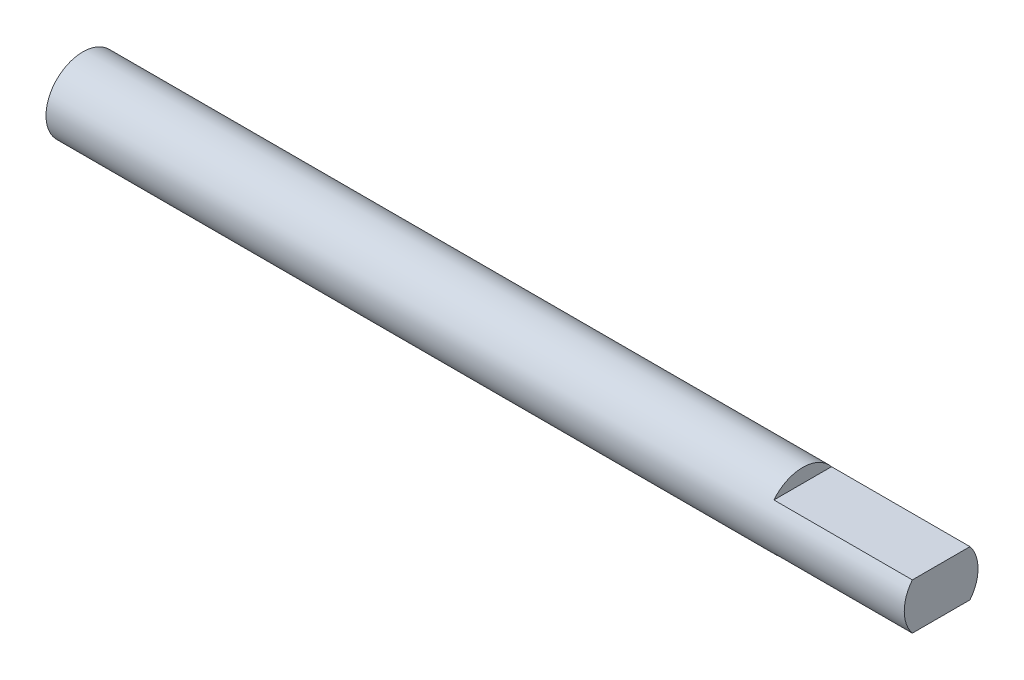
from build123d import *

# Parameters (mm, degrees)
ESQUISSE1_W                  = 93
ESQUISSE1_H                  = 4
ENL_V_MAT_EXTRU_1_DEPTH      = 15
R_P_TITION_CIRCULAIRE1_COUNT = 2


with BuildPart() as part:
    # Esquisse1 → Base-R_volution (revolve)
    with BuildSketch(Plane.XY, mode=Mode.PRIVATE) as base_r_volution_sk:
        with Locations((46.5, 2)):
            Rectangle(ESQUISSE1_W, ESQUISSE1_H)
    revolve(base_r_volution_sk.sketch.rotate(Axis((0, 0, 0), (1, 0, 0)), 90), axis=Axis((0, 0, 0), (1, 0, 0)))

    # Esquisse2 → Enl_v. mat.-Extru.1 (cut)
    with BuildSketch(Plane(origin=(93, 0, 0), x_dir=(0, 0, -1), z_dir=(1, 0, 0))):
        Polygon((-4.388185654, 2.5), (4.321998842, 2.5), (0.350790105, 4.686026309), align=None)
    enl_v_mat_extru_1 = extrude(amount=-ENL_V_MAT_EXTRU_1_DEPTH, mode=Mode.SUBTRACT)

    # R_p_tition circulaire1: Enl_v. mat.-Extru.1 ×2 about axis
    r_p_tition_circulaire1_axis = Axis((0, 0, 0), (1, 0, 0))
    for i in range(1, R_P_TITION_CIRCULAIRE1_COUNT):
        add(enl_v_mat_extru_1.rotate(r_p_tition_circulaire1_axis, i * 360 / R_P_TITION_CIRCULAIRE1_COUNT), mode=Mode.SUBTRACT)


solid = part.part
